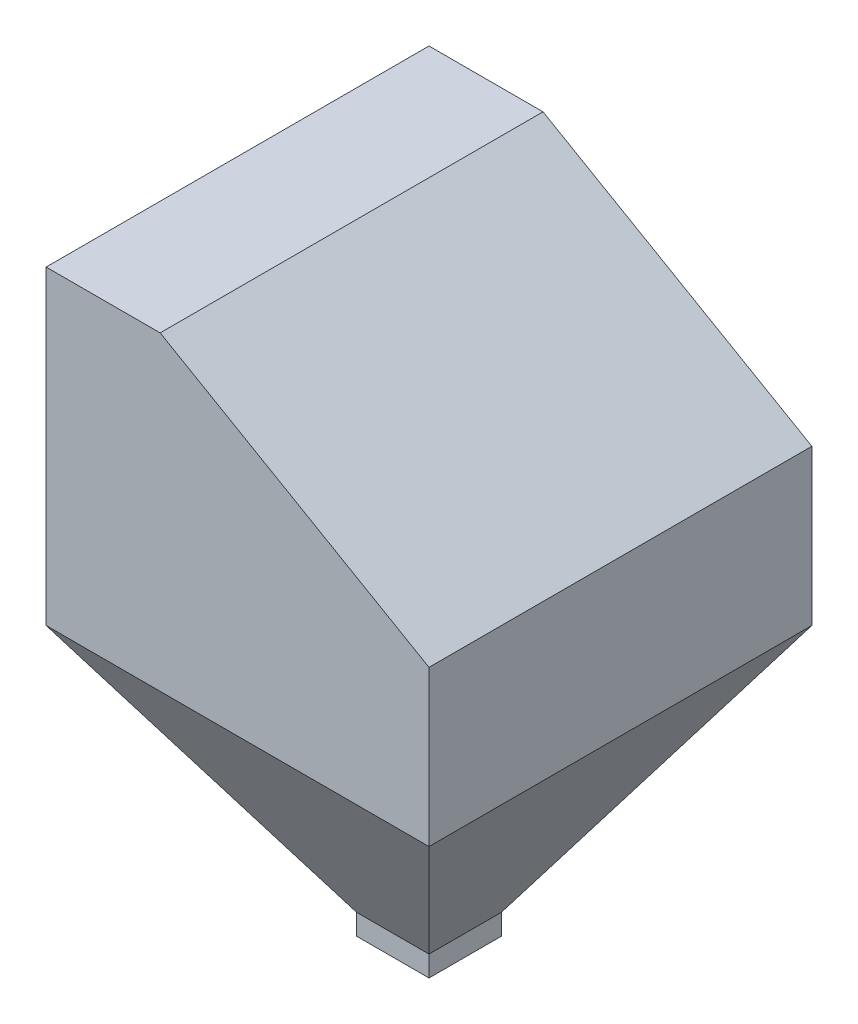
ISO-10303-21;
HEADER;
FILE_DESCRIPTION(('STEP AP214'),'2;1');
FILE_NAME('part.step','',(''),(''),'','','');
FILE_SCHEMA(('AUTOMOTIVE_DESIGN { 1 0 10303 214 1 1 1 1 }'));
ENDSEC;
DATA;
#1=APPLICATION_CONTEXT('core data for automotive mechanical design processes');
#2=APPLICATION_PROTOCOL_DEFINITION('international standard','automotive_design',2000,#1);
#3=PRODUCT_CONTEXT('',#1,'mechanical');
#4=PRODUCT('Part','Part','',(#3));
#5=PRODUCT_RELATED_PRODUCT_CATEGORY('part','',(#4));
#6=PRODUCT_DEFINITION_FORMATION('','',#4);
#7=PRODUCT_DEFINITION_CONTEXT('part definition',#1,'design');
#8=PRODUCT_DEFINITION('design','',#6,#7);
#9=PRODUCT_DEFINITION_SHAPE('','',#8);
#10=(LENGTH_UNIT() NAMED_UNIT(*) SI_UNIT(.MILLI.,.METRE.));
#11=(NAMED_UNIT(*) PLANE_ANGLE_UNIT() SI_UNIT($,.RADIAN.));
#12=(NAMED_UNIT(*) SI_UNIT($,.STERADIAN.) SOLID_ANGLE_UNIT());
#13=UNCERTAINTY_MEASURE_WITH_UNIT(LENGTH_MEASURE(1.E-05),#10,'distance_accuracy_value','');
#14=(GEOMETRIC_REPRESENTATION_CONTEXT(3) GLOBAL_UNCERTAINTY_ASSIGNED_CONTEXT((#13)) GLOBAL_UNIT_ASSIGNED_CONTEXT((#10,
#11,#12)) REPRESENTATION_CONTEXT('',''));
#15=CARTESIAN_POINT('',(0.,0.,0.));
#16=DIRECTION('',(0.,0.,1.));
#17=DIRECTION('',(1.,0.,0.));
#18=AXIS2_PLACEMENT_3D('',#15,#16,#17);
#19=CARTESIAN_POINT('',(62.9213483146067,-39.3258426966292,0.));
#20=DIRECTION('',(-0.847998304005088,0.52999894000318,0.));
#21=DIRECTION('',(-0.52999894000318,-0.847998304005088,0.));
#22=AXIS2_PLACEMENT_3D('',#19,#20,#21);
#23=PLANE('',#22);
#24=DIRECTION('',(0.468292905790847,0.749268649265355,-0.468292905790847));
#25=VECTOR('',#24,1.);
#26=CARTESIAN_POINT('',(87.5,0.,-87.5));
#27=LINE('',#26,#25);
#28=CARTESIAN_POINT('',(87.5,0.,-87.5));
#29=VERTEX_POINT('',#28);
#30=CARTESIAN_POINT('',(462.5,600.,-462.5));
#31=VERTEX_POINT('',#30);
#32=EDGE_CURVE('E336',#29,#31,#27,.T.);
#33=ORIENTED_EDGE('',*,*,#32,.T.);
#34=DIRECTION('',(0.,0.,-1.));
#35=VECTOR('',#34,1.);
#36=CARTESIAN_POINT('',(462.5,600.,462.5));
#37=LINE('',#36,#35);
#38=CARTESIAN_POINT('',(462.5,600.,462.5));
#39=VERTEX_POINT('',#38);
#40=EDGE_CURVE('E226',#39,#31,#37,.T.);
#41=ORIENTED_EDGE('',*,*,#40,.F.);
#42=DIRECTION('',(0.468292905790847,0.749268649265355,0.468292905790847));
#43=VECTOR('',#42,1.);
#44=CARTESIAN_POINT('',(87.5,0.,87.5));
#45=LINE('',#44,#43);
#46=CARTESIAN_POINT('',(87.5,0.,87.5));
#47=VERTEX_POINT('',#46);
#48=EDGE_CURVE('E380',#47,#39,#45,.T.);
#49=ORIENTED_EDGE('',*,*,#48,.F.);
#50=DIRECTION('',(0.,0.,-1.));
#51=VECTOR('',#50,1.);
#52=CARTESIAN_POINT('',(87.5,0.,87.5));
#53=LINE('',#52,#51);
#54=EDGE_CURVE('E157',#47,#29,#53,.T.);
#55=ORIENTED_EDGE('',*,*,#54,.T.);
#56=EDGE_LOOP('',(#33,#41,#49,#55));
#57=FACE_BOUND('',#56,.T.);
#58=ADVANCED_FACE('F44',(#57),#23,.F.);
#59=CARTESIAN_POINT('',(0.,-39.3258426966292,62.9213483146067));
#60=DIRECTION('',(0.,0.52999894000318,-0.847998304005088));
#61=DIRECTION('',(0.,0.847998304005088,0.52999894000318));
#62=AXIS2_PLACEMENT_3D('',#59,#60,#61);
#63=PLANE('',#62);
#64=ORIENTED_EDGE('',*,*,#48,.T.);
#65=DIRECTION('',(1.,0.,0.));
#66=VECTOR('',#65,1.);
#67=CARTESIAN_POINT('',(-462.5,600.,462.5));
#68=LINE('',#67,#66);
#69=CARTESIAN_POINT('',(-462.5,600.,462.5));
#70=VERTEX_POINT('',#69);
#71=EDGE_CURVE('E55',#70,#39,#68,.T.);
#72=ORIENTED_EDGE('',*,*,#71,.F.);
#73=DIRECTION('',(-0.468292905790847,0.749268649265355,0.468292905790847));
#74=VECTOR('',#73,1.);
#75=CARTESIAN_POINT('',(-87.5,0.,87.5));
#76=LINE('',#75,#74);
#77=CARTESIAN_POINT('',(-87.5,0.,87.5));
#78=VERTEX_POINT('',#77);
#79=EDGE_CURVE('E266',#78,#70,#76,.T.);
#80=ORIENTED_EDGE('',*,*,#79,.F.);
#81=DIRECTION('',(1.,0.,0.));
#82=VECTOR('',#81,1.);
#83=CARTESIAN_POINT('',(-87.5,0.,87.5));
#84=LINE('',#83,#82);
#85=EDGE_CURVE('E261',#78,#47,#84,.T.);
#86=ORIENTED_EDGE('',*,*,#85,.T.);
#87=EDGE_LOOP('',(#64,#72,#80,#86));
#88=FACE_BOUND('',#87,.T.);
#89=ADVANCED_FACE('F268',(#88),#63,.F.);
#90=CARTESIAN_POINT('',(0.,-39.3258426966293,-62.9213483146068));
#91=DIRECTION('',(0.,0.52999894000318,0.847998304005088));
#92=DIRECTION('',(0.,-0.847998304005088,0.52999894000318));
#93=AXIS2_PLACEMENT_3D('',#90,#91,#92);
#94=PLANE('',#93);
#95=DIRECTION('',(-0.468292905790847,0.749268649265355,-0.468292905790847));
#96=VECTOR('',#95,1.);
#97=CARTESIAN_POINT('',(-87.5,0.,-87.5));
#98=LINE('',#97,#96);
#99=CARTESIAN_POINT('',(-87.5,0.,-87.5));
#100=VERTEX_POINT('',#99);
#101=CARTESIAN_POINT('',(-462.5,600.,-462.5));
#102=VERTEX_POINT('',#101);
#103=EDGE_CURVE('E385',#100,#102,#98,.T.);
#104=ORIENTED_EDGE('',*,*,#103,.T.);
#105=DIRECTION('',(-1.,0.,0.));
#106=VECTOR('',#105,1.);
#107=CARTESIAN_POINT('',(-462.5,600.,-462.5));
#108=LINE('',#107,#106);
#109=EDGE_CURVE('E218',#31,#102,#108,.T.);
#110=ORIENTED_EDGE('',*,*,#109,.F.);
#111=ORIENTED_EDGE('',*,*,#32,.F.);
#112=DIRECTION('',(-1.,0.,0.));
#113=VECTOR('',#112,1.);
#114=CARTESIAN_POINT('',(-87.5,0.,-87.5));
#115=LINE('',#114,#113);
#116=EDGE_CURVE('E141',#29,#100,#115,.T.);
#117=ORIENTED_EDGE('',*,*,#116,.T.);
#118=EDGE_LOOP('',(#104,#110,#111,#117));
#119=FACE_BOUND('',#118,.T.);
#120=ADVANCED_FACE('F277',(#119),#94,.F.);
#121=CARTESIAN_POINT('',(-62.9213483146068,-39.3258426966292,0.));
#122=DIRECTION('',(0.847998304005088,0.52999894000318,0.));
#123=DIRECTION('',(-0.52999894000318,0.847998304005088,0.));
#124=AXIS2_PLACEMENT_3D('',#121,#122,#123);
#125=PLANE('',#124);
#126=ORIENTED_EDGE('',*,*,#79,.T.);
#127=DIRECTION('',(0.,0.,1.));
#128=VECTOR('',#127,1.);
#129=CARTESIAN_POINT('',(-462.5,600.,462.5));
#130=LINE('',#129,#128);
#131=EDGE_CURVE('E171',#102,#70,#130,.T.);
#132=ORIENTED_EDGE('',*,*,#131,.F.);
#133=ORIENTED_EDGE('',*,*,#103,.F.);
#134=DIRECTION('',(0.,0.,1.));
#135=VECTOR('',#134,1.);
#136=CARTESIAN_POINT('',(-87.5,0.,87.5));
#137=LINE('',#136,#135);
#138=EDGE_CURVE('E49',#100,#78,#137,.T.);
#139=ORIENTED_EDGE('',*,*,#138,.T.);
#140=EDGE_LOOP('',(#126,#132,#133,#139));
#141=FACE_BOUND('',#140,.T.);
#142=ADVANCED_FACE('F46',(#141),#125,.F.);
#143=CARTESIAN_POINT('',(-462.5,1350.,462.5));
#144=DIRECTION('',(0.,0.,-1.));
#145=DIRECTION('',(-1.,0.,0.));
#146=AXIS2_PLACEMENT_3D('',#143,#144,#145);
#147=PLANE('',#146);
#148=DIRECTION('',(0.,-1.,0.));
#149=VECTOR('',#148,1.);
#150=CARTESIAN_POINT('',(462.5,1350.,462.5));
#151=LINE('',#150,#149);
#152=CARTESIAN_POINT('',(462.5,975.,462.5));
#153=VERTEX_POINT('',#152);
#154=EDGE_CURVE('E234',#153,#39,#151,.T.);
#155=ORIENTED_EDGE('',*,*,#154,.F.);
#156=DIRECTION('',(-0.866025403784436,0.500000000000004,0.));
#157=VECTOR('',#156,1.);
#158=CARTESIAN_POINT('',(-393.629763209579,1469.28674925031,462.5));
#159=LINE('',#158,#157);
#160=CARTESIAN_POINT('',(-187.019052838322,1350.,462.5));
#161=VERTEX_POINT('',#160);
#162=EDGE_CURVE('E248',#153,#161,#159,.T.);
#163=ORIENTED_EDGE('',*,*,#162,.T.);
#164=DIRECTION('',(1.,0.,0.));
#165=VECTOR('',#164,1.);
#166=CARTESIAN_POINT('',(-462.5,1350.,462.5));
#167=LINE('',#166,#165);
#168=CARTESIAN_POINT('',(-462.5,1350.,462.5));
#169=VERTEX_POINT('',#168);
#170=EDGE_CURVE('E251',#169,#161,#167,.T.);
#171=ORIENTED_EDGE('',*,*,#170,.F.);
#172=DIRECTION('',(0.,-1.,0.));
#173=VECTOR('',#172,1.);
#174=CARTESIAN_POINT('',(-462.5,1350.,462.5));
#175=LINE('',#174,#173);
#176=EDGE_CURVE('E176',#169,#70,#175,.T.);
#177=ORIENTED_EDGE('',*,*,#176,.T.);
#178=ORIENTED_EDGE('',*,*,#71,.T.);
#179=EDGE_LOOP('',(#155,#163,#171,#177,#178));
#180=FACE_BOUND('',#179,.T.);
#181=ADVANCED_FACE('F421',(#180),#147,.F.);
#182=CARTESIAN_POINT('',(462.5,1350.,462.5));
#183=DIRECTION('',(-1.,0.,0.));
#184=DIRECTION('',(0.,0.,1.));
#185=AXIS2_PLACEMENT_3D('',#182,#183,#184);
#186=PLANE('',#185);
#187=DIRECTION('',(0.,-1.,0.));
#188=VECTOR('',#187,1.);
#189=CARTESIAN_POINT('',(462.5,1350.,-462.5));
#190=LINE('',#189,#188);
#191=CARTESIAN_POINT('',(462.5,975.,-462.5));
#192=VERTEX_POINT('',#191);
#193=EDGE_CURVE('E237',#192,#31,#190,.T.);
#194=ORIENTED_EDGE('',*,*,#193,.F.);
#195=DIRECTION('',(0.,0.,-1.));
#196=VECTOR('',#195,1.);
#197=CARTESIAN_POINT('',(462.5,975.,3281.03425788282));
#198=LINE('',#197,#196);
#199=EDGE_CURVE('E63',#153,#192,#198,.T.);
#200=ORIENTED_EDGE('',*,*,#199,.F.);
#201=ORIENTED_EDGE('',*,*,#154,.T.);
#202=ORIENTED_EDGE('',*,*,#40,.T.);
#203=EDGE_LOOP('',(#194,#200,#201,#202));
#204=FACE_BOUND('',#203,.T.);
#205=ADVANCED_FACE('F209',(#204),#186,.F.);
#206=CARTESIAN_POINT('',(462.5,1350.,-462.5));
#207=DIRECTION('',(0.,0.,1.));
#208=DIRECTION('',(1.,0.,0.));
#209=AXIS2_PLACEMENT_3D('',#206,#207,#208);
#210=PLANE('',#209);
#211=DIRECTION('',(-1.,0.,0.));
#212=VECTOR('',#211,1.);
#213=CARTESIAN_POINT('',(462.5,1350.,-462.5));
#214=LINE('',#213,#212);
#215=CARTESIAN_POINT('',(-187.019052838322,1350.,-462.5));
#216=VERTEX_POINT('',#215);
#217=CARTESIAN_POINT('',(-462.5,1350.,-462.5));
#218=VERTEX_POINT('',#217);
#219=EDGE_CURVE('E253',#216,#218,#214,.T.);
#220=ORIENTED_EDGE('',*,*,#219,.F.);
#221=DIRECTION('',(0.866025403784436,-0.500000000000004,0.));
#222=VECTOR('',#221,1.);
#223=CARTESIAN_POINT('',(300.120236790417,1068.75,-462.5));
#224=LINE('',#223,#222);
#225=EDGE_CURVE('E71',#216,#192,#224,.T.);
#226=ORIENTED_EDGE('',*,*,#225,.T.);
#227=ORIENTED_EDGE('',*,*,#193,.T.);
#228=ORIENTED_EDGE('',*,*,#109,.T.);
#229=DIRECTION('',(0.,-1.,0.));
#230=VECTOR('',#229,1.);
#231=CARTESIAN_POINT('',(-462.5,1350.,-462.5));
#232=LINE('',#231,#230);
#233=EDGE_CURVE('E179',#218,#102,#232,.T.);
#234=ORIENTED_EDGE('',*,*,#233,.F.);
#235=EDGE_LOOP('',(#220,#226,#227,#228,#234));
#236=FACE_BOUND('',#235,.T.);
#237=ADVANCED_FACE('F204',(#236),#210,.F.);
#238=CARTESIAN_POINT('',(-462.5,1350.,-462.5));
#239=DIRECTION('',(1.,0.,0.));
#240=DIRECTION('',(0.,0.,-1.));
#241=AXIS2_PLACEMENT_3D('',#238,#239,#240);
#242=PLANE('',#241);
#243=ORIENTED_EDGE('',*,*,#131,.T.);
#244=ORIENTED_EDGE('',*,*,#176,.F.);
#245=DIRECTION('',(0.,0.,1.));
#246=VECTOR('',#245,1.);
#247=CARTESIAN_POINT('',(-462.5,1350.,-462.5));
#248=LINE('',#247,#246);
#249=EDGE_CURVE('E180',#218,#169,#248,.T.);
#250=ORIENTED_EDGE('',*,*,#249,.F.);
#251=ORIENTED_EDGE('',*,*,#233,.T.);
#252=EDGE_LOOP('',(#243,#244,#250,#251));
#253=FACE_BOUND('',#252,.T.);
#254=ADVANCED_FACE('F193',(#253),#242,.F.);
#255=CARTESIAN_POINT('',(0.,1350.,0.));
#256=DIRECTION('',(0.,1.,0.));
#257=DIRECTION('',(0.,0.,1.));
#258=AXIS2_PLACEMENT_3D('',#255,#256,#257);
#259=PLANE('',#258);
#260=DIRECTION('',(0.,0.,1.));
#261=VECTOR('',#260,1.);
#262=CARTESIAN_POINT('',(-187.019052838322,1350.,0.));
#263=LINE('',#262,#261);
#264=EDGE_CURVE('E12',#216,#161,#263,.T.);
#265=ORIENTED_EDGE('',*,*,#264,.F.);
#266=ORIENTED_EDGE('',*,*,#219,.T.);
#267=ORIENTED_EDGE('',*,*,#249,.T.);
#268=ORIENTED_EDGE('',*,*,#170,.T.);
#269=EDGE_LOOP('',(#265,#266,#267,#268));
#270=FACE_BOUND('',#269,.T.);
#271=ADVANCED_FACE('F203',(#270),#259,.T.);
#272=CARTESIAN_POINT('',(462.5,975.,3281.03425788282));
#273=DIRECTION('',(-0.500000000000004,-0.866025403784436,0.));
#274=DIRECTION('',(0.866025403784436,-0.500000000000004,0.));
#275=AXIS2_PLACEMENT_3D('',#272,#273,#274);
#276=PLANE('',#275);
#277=ORIENTED_EDGE('',*,*,#162,.F.);
#278=ORIENTED_EDGE('',*,*,#199,.T.);
#279=ORIENTED_EDGE('',*,*,#225,.F.);
#280=ORIENTED_EDGE('',*,*,#264,.T.);
#281=EDGE_LOOP('',(#277,#278,#279,#280));
#282=FACE_BOUND('',#281,.T.);
#283=ADVANCED_FACE('F424',(#282),#276,.F.);
#284=CARTESIAN_POINT('',(-87.5,-50.,-87.5));
#285=DIRECTION('',(0.,0.,1.));
#286=DIRECTION('',(1.,0.,0.));
#287=AXIS2_PLACEMENT_3D('',#284,#285,#286);
#288=PLANE('',#287);
#289=ORIENTED_EDGE('',*,*,#116,.F.);
#290=DIRECTION('',(0.,1.,0.));
#291=VECTOR('',#290,1.);
#292=CARTESIAN_POINT('',(87.5,-50.,-87.5));
#293=LINE('',#292,#291);
#294=CARTESIAN_POINT('',(87.5,-50.,-87.5));
#295=VERTEX_POINT('',#294);
#296=EDGE_CURVE('E123',#295,#29,#293,.T.);
#297=ORIENTED_EDGE('',*,*,#296,.F.);
#298=DIRECTION('',(1.,0.,0.));
#299=VECTOR('',#298,1.);
#300=CARTESIAN_POINT('',(-87.5,-50.,-87.5));
#301=LINE('',#300,#299);
#302=CARTESIAN_POINT('',(-87.5,-50.,-87.5));
#303=VERTEX_POINT('',#302);
#304=EDGE_CURVE('E130',#303,#295,#301,.T.);
#305=ORIENTED_EDGE('',*,*,#304,.F.);
#306=DIRECTION('',(0.,1.,0.));
#307=VECTOR('',#306,1.);
#308=CARTESIAN_POINT('',(-87.5,-50.,-87.5));
#309=LINE('',#308,#307);
#310=EDGE_CURVE('E238',#303,#100,#309,.T.);
#311=ORIENTED_EDGE('',*,*,#310,.T.);
#312=EDGE_LOOP('',(#289,#297,#305,#311));
#313=FACE_BOUND('',#312,.T.);
#314=ADVANCED_FACE('F139',(#313),#288,.F.);
#315=CARTESIAN_POINT('',(87.5,-50.,-87.5));
#316=DIRECTION('',(-1.,0.,0.));
#317=DIRECTION('',(0.,0.,1.));
#318=AXIS2_PLACEMENT_3D('',#315,#316,#317);
#319=PLANE('',#318);
#320=ORIENTED_EDGE('',*,*,#54,.F.);
#321=DIRECTION('',(0.,1.,0.));
#322=VECTOR('',#321,1.);
#323=CARTESIAN_POINT('',(87.5,-50.,87.5));
#324=LINE('',#323,#322);
#325=CARTESIAN_POINT('',(87.5,-50.,87.5));
#326=VERTEX_POINT('',#325);
#327=EDGE_CURVE('E126',#326,#47,#324,.T.);
#328=ORIENTED_EDGE('',*,*,#327,.F.);
#329=DIRECTION('',(0.,0.,1.));
#330=VECTOR('',#329,1.);
#331=CARTESIAN_POINT('',(87.5,-50.,-87.5));
#332=LINE('',#331,#330);
#333=EDGE_CURVE('E119',#295,#326,#332,.T.);
#334=ORIENTED_EDGE('',*,*,#333,.F.);
#335=ORIENTED_EDGE('',*,*,#296,.T.);
#336=EDGE_LOOP('',(#320,#328,#334,#335));
#337=FACE_BOUND('',#336,.T.);
#338=ADVANCED_FACE('F121',(#337),#319,.F.);
#339=CARTESIAN_POINT('',(87.5,-50.,87.5));
#340=DIRECTION('',(0.,0.,-1.));
#341=DIRECTION('',(-1.,0.,0.));
#342=AXIS2_PLACEMENT_3D('',#339,#340,#341);
#343=PLANE('',#342);
#344=ORIENTED_EDGE('',*,*,#85,.F.);
#345=DIRECTION('',(0.,1.,0.));
#346=VECTOR('',#345,1.);
#347=CARTESIAN_POINT('',(-87.5,-50.,87.5));
#348=LINE('',#347,#346);
#349=CARTESIAN_POINT('',(-87.5,-50.,87.5));
#350=VERTEX_POINT('',#349);
#351=EDGE_CURVE('E146',#350,#78,#348,.T.);
#352=ORIENTED_EDGE('',*,*,#351,.F.);
#353=DIRECTION('',(-1.,0.,0.));
#354=VECTOR('',#353,1.);
#355=CARTESIAN_POINT('',(87.5,-50.,87.5));
#356=LINE('',#355,#354);
#357=EDGE_CURVE('E129',#326,#350,#356,.T.);
#358=ORIENTED_EDGE('',*,*,#357,.F.);
#359=ORIENTED_EDGE('',*,*,#327,.T.);
#360=EDGE_LOOP('',(#344,#352,#358,#359));
#361=FACE_BOUND('',#360,.T.);
#362=ADVANCED_FACE('F353',(#361),#343,.F.);
#363=CARTESIAN_POINT('',(-87.5,-50.,87.5));
#364=DIRECTION('',(1.,0.,0.));
#365=DIRECTION('',(0.,0.,-1.));
#366=AXIS2_PLACEMENT_3D('',#363,#364,#365);
#367=PLANE('',#366);
#368=ORIENTED_EDGE('',*,*,#138,.F.);
#369=ORIENTED_EDGE('',*,*,#310,.F.);
#370=DIRECTION('',(0.,0.,-1.));
#371=VECTOR('',#370,1.);
#372=CARTESIAN_POINT('',(-87.5,-50.,87.5));
#373=LINE('',#372,#371);
#374=EDGE_CURVE('E135',#350,#303,#373,.T.);
#375=ORIENTED_EDGE('',*,*,#374,.F.);
#376=ORIENTED_EDGE('',*,*,#351,.T.);
#377=EDGE_LOOP('',(#368,#369,#375,#376));
#378=FACE_BOUND('',#377,.T.);
#379=ADVANCED_FACE('F343',(#378),#367,.F.);
#380=CARTESIAN_POINT('',(0.,-50.,0.));
#381=DIRECTION('',(0.,-1.,0.));
#382=DIRECTION('',(0.,0.,-1.));
#383=AXIS2_PLACEMENT_3D('',#380,#381,#382);
#384=PLANE('',#383);
#385=ORIENTED_EDGE('',*,*,#304,.T.);
#386=ORIENTED_EDGE('',*,*,#333,.T.);
#387=ORIENTED_EDGE('',*,*,#357,.T.);
#388=ORIENTED_EDGE('',*,*,#374,.T.);
#389=EDGE_LOOP('',(#385,#386,#387,#388));
#390=FACE_BOUND('',#389,.T.);
#391=ADVANCED_FACE('F133',(#390),#384,.T.);
#392=CLOSED_SHELL('',(#58,#89,#120,#142,#181,#205,#237,#254,#271,#283,#314,#338,#362,#379,#391));
#393=MANIFOLD_SOLID_BREP('B2',#392);
#394=ADVANCED_BREP_SHAPE_REPRESENTATION('',(#18,#393),#14);
#395=SHAPE_DEFINITION_REPRESENTATION(#9,#394);
ENDSEC;
END-ISO-10303-21;
